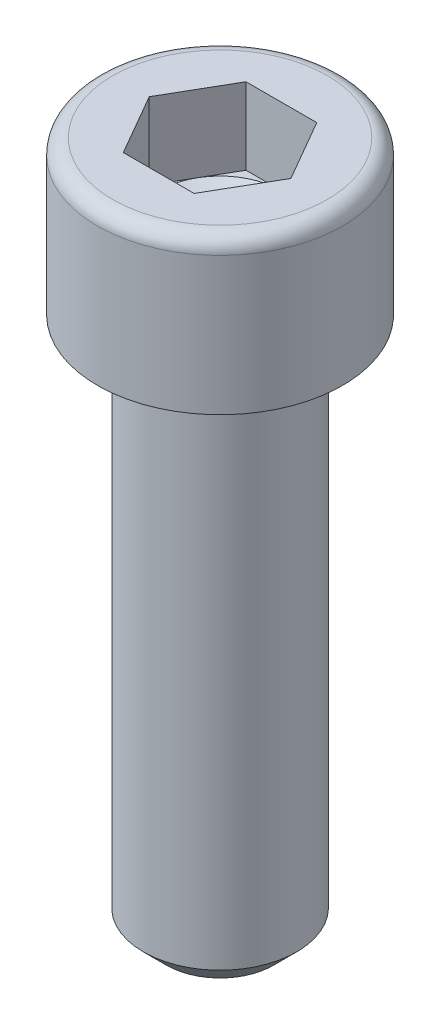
ISO-10303-21;
HEADER;
FILE_DESCRIPTION(('STEP AP214'),'2;1');
FILE_NAME('part.step','',(''),(''),'','','');
FILE_SCHEMA(('AUTOMOTIVE_DESIGN { 1 0 10303 214 1 1 1 1 }'));
ENDSEC;
DATA;
#1=APPLICATION_CONTEXT('core data for automotive mechanical design processes');
#2=APPLICATION_PROTOCOL_DEFINITION('international standard','automotive_design',2000,#1);
#3=PRODUCT_CONTEXT('',#1,'mechanical');
#4=PRODUCT('Part','Part','',(#3));
#5=PRODUCT_RELATED_PRODUCT_CATEGORY('part','',(#4));
#6=PRODUCT_DEFINITION_FORMATION('','',#4);
#7=PRODUCT_DEFINITION_CONTEXT('part definition',#1,'design');
#8=PRODUCT_DEFINITION('design','',#6,#7);
#9=PRODUCT_DEFINITION_SHAPE('','',#8);
#10=(LENGTH_UNIT() NAMED_UNIT(*) SI_UNIT(.MILLI.,.METRE.));
#11=(NAMED_UNIT(*) PLANE_ANGLE_UNIT() SI_UNIT($,.RADIAN.));
#12=(NAMED_UNIT(*) SI_UNIT($,.STERADIAN.) SOLID_ANGLE_UNIT());
#13=UNCERTAINTY_MEASURE_WITH_UNIT(LENGTH_MEASURE(1.E-05),#10,'distance_accuracy_value','');
#14=(GEOMETRIC_REPRESENTATION_CONTEXT(3) GLOBAL_UNCERTAINTY_ASSIGNED_CONTEXT((#13)) GLOBAL_UNIT_ASSIGNED_CONTEXT((#10,
#11,#12)) REPRESENTATION_CONTEXT('',''));
#15=CARTESIAN_POINT('',(0.,0.,0.));
#16=DIRECTION('',(0.,0.,1.));
#17=DIRECTION('',(1.,0.,0.));
#18=AXIS2_PLACEMENT_3D('',#15,#16,#17);
#19=CARTESIAN_POINT('',(4.,10.,0.));
#20=DIRECTION('',(0.,-1.,0.));
#21=DIRECTION('',(1.,0.,0.));
#22=AXIS2_PLACEMENT_3D('',#19,#20,#21);
#23=PLANE('',#22);
#24=CARTESIAN_POINT('',(0.,10.,0.));
#25=DIRECTION('',(0.,1.,0.));
#26=DIRECTION('',(-1.,0.,0.));
#27=AXIS2_PLACEMENT_3D('',#24,#25,#26);
#28=CIRCLE('',#27,7.);
#29=CARTESIAN_POINT('',(-7.,10.,0.));
#30=VERTEX_POINT('',#29);
#31=EDGE_CURVE('E141',#30,#30,#28,.T.);
#32=ORIENTED_EDGE('',*,*,#31,.T.);
#33=EDGE_LOOP('',(#32));
#34=FACE_BOUND('',#33,.T.);
#35=DIRECTION('',(0.499999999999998,0.,0.86602540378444));
#36=VECTOR('',#35,1.);
#37=CARTESIAN_POINT('',(2.30940107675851,10.,-4.));
#38=LINE('',#37,#36);
#39=CARTESIAN_POINT('',(2.30940107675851,10.,-4.));
#40=VERTEX_POINT('',#39);
#41=CARTESIAN_POINT('',(4.618802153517,10.,0.));
#42=VERTEX_POINT('',#41);
#43=EDGE_CURVE('E373',#40,#42,#38,.T.);
#44=ORIENTED_EDGE('',*,*,#43,.T.);
#45=DIRECTION('',(-0.499999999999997,0.,0.86602540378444));
#46=VECTOR('',#45,1.);
#47=CARTESIAN_POINT('',(2.30940107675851,10.,4.));
#48=LINE('',#47,#46);
#49=CARTESIAN_POINT('',(2.30940107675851,10.,4.));
#50=VERTEX_POINT('',#49);
#51=EDGE_CURVE('E376',#42,#50,#48,.T.);
#52=ORIENTED_EDGE('',*,*,#51,.T.);
#53=DIRECTION('',(-1.,0.,0.));
#54=VECTOR('',#53,1.);
#55=CARTESIAN_POINT('',(2.30940107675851,10.,4.));
#56=LINE('',#55,#54);
#57=CARTESIAN_POINT('',(-2.30940107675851,10.,4.));
#58=VERTEX_POINT('',#57);
#59=EDGE_CURVE('E379',#50,#58,#56,.T.);
#60=ORIENTED_EDGE('',*,*,#59,.T.);
#61=DIRECTION('',(-0.499999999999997,0.,-0.86602540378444));
#62=VECTOR('',#61,1.);
#63=CARTESIAN_POINT('',(-2.30940107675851,10.,4.));
#64=LINE('',#63,#62);
#65=CARTESIAN_POINT('',(-4.618802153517,10.,0.));
#66=VERTEX_POINT('',#65);
#67=EDGE_CURVE('E118',#58,#66,#64,.T.);
#68=ORIENTED_EDGE('',*,*,#67,.T.);
#69=DIRECTION('',(0.499999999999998,0.,-0.86602540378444));
#70=VECTOR('',#69,1.);
#71=CARTESIAN_POINT('',(-2.30940107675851,10.,-4.));
#72=LINE('',#71,#70);
#73=CARTESIAN_POINT('',(-2.30940107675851,10.,-4.));
#74=VERTEX_POINT('',#73);
#75=EDGE_CURVE('E370',#66,#74,#72,.T.);
#76=ORIENTED_EDGE('',*,*,#75,.T.);
#77=DIRECTION('',(1.,0.,0.));
#78=VECTOR('',#77,1.);
#79=CARTESIAN_POINT('',(2.30940107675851,10.,-4.));
#80=LINE('',#79,#78);
#81=EDGE_CURVE('E129',#74,#40,#80,.T.);
#82=ORIENTED_EDGE('',*,*,#81,.T.);
#83=EDGE_LOOP('',(#44,#52,#60,#68,#76,#82));
#84=FACE_BOUND('',#83,.T.);
#85=ADVANCED_FACE('F35',(#34,#84),#23,.F.);
#86=CARTESIAN_POINT('',(0.,-35.,0.));
#87=DIRECTION('',(0.,1.,0.));
#88=DIRECTION('',(0.,0.,1.));
#89=AXIS2_PLACEMENT_3D('',#86,#87,#88);
#90=CYLINDRICAL_SURFACE('',#89,5.);
#91=CARTESIAN_POINT('',(0.,-33.5,0.));
#92=DIRECTION('',(0.,1.,0.));
#93=DIRECTION('',(0.,0.,1.));
#94=AXIS2_PLACEMENT_3D('',#91,#92,#93);
#95=CIRCLE('',#94,5.);
#96=CARTESIAN_POINT('',(0.,-33.5,5.));
#97=VERTEX_POINT('',#96);
#98=EDGE_CURVE('E43',#97,#97,#95,.T.);
#99=ORIENTED_EDGE('',*,*,#98,.T.);
#100=EDGE_LOOP('',(#99));
#101=FACE_BOUND('',#100,.T.);
#102=CARTESIAN_POINT('',(0.,0.,0.));
#103=DIRECTION('',(0.,1.,0.));
#104=DIRECTION('',(0.,0.,1.));
#105=AXIS2_PLACEMENT_3D('',#102,#103,#104);
#106=CIRCLE('',#105,5.);
#107=CARTESIAN_POINT('',(0.,0.,5.));
#108=VERTEX_POINT('',#107);
#109=EDGE_CURVE('E151',#108,#108,#106,.T.);
#110=ORIENTED_EDGE('',*,*,#109,.F.);
#111=EDGE_LOOP('',(#110));
#112=FACE_BOUND('',#111,.T.);
#113=ADVANCED_FACE('F156',(#101,#112),#90,.T.);
#114=CARTESIAN_POINT('',(0.,-35.,0.));
#115=DIRECTION('',(0.,1.,0.));
#116=DIRECTION('',(0.,0.,1.));
#117=AXIS2_PLACEMENT_3D('',#114,#115,#116);
#118=PLANE('',#117);
#119=CARTESIAN_POINT('',(0.,-35.,0.));
#120=DIRECTION('',(0.,1.,0.));
#121=DIRECTION('',(0.,0.,1.));
#122=AXIS2_PLACEMENT_3D('',#119,#120,#121);
#123=CIRCLE('',#122,3.49999999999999);
#124=CARTESIAN_POINT('',(0.,-35.,3.49999999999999));
#125=VERTEX_POINT('',#124);
#126=EDGE_CURVE('E11',#125,#125,#123,.F.);
#127=ORIENTED_EDGE('',*,*,#126,.T.);
#128=EDGE_LOOP('',(#127));
#129=FACE_BOUND('',#128,.T.);
#130=ADVANCED_FACE('F161',(#129),#118,.F.);
#131=CARTESIAN_POINT('',(0.,-33.5,0.));
#132=DIRECTION('',(0.,1.,0.));
#133=DIRECTION('',(0.,0.,1.));
#134=AXIS2_PLACEMENT_3D('',#131,#132,#133);
#135=CONICAL_SURFACE('',#134,5.,0.785398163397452);
#136=ORIENTED_EDGE('',*,*,#126,.F.);
#137=EDGE_LOOP('',(#136));
#138=FACE_BOUND('',#137,.T.);
#139=ORIENTED_EDGE('',*,*,#98,.F.);
#140=EDGE_LOOP('',(#139));
#141=FACE_BOUND('',#140,.T.);
#142=ADVANCED_FACE('F37',(#138,#141),#135,.T.);
#143=CARTESIAN_POINT('',(0.,0.,0.));
#144=DIRECTION('',(0.,1.,0.));
#145=DIRECTION('',(-1.,0.,0.));
#146=AXIS2_PLACEMENT_3D('',#143,#144,#145);
#147=PLANE('',#146);
#148=ORIENTED_EDGE('',*,*,#109,.T.);
#149=EDGE_LOOP('',(#148));
#150=FACE_BOUND('',#149,.T.);
#151=CARTESIAN_POINT('',(0.,0.,0.));
#152=DIRECTION('',(0.,1.,0.));
#153=DIRECTION('',(-1.,0.,0.));
#154=AXIS2_PLACEMENT_3D('',#151,#152,#153);
#155=CIRCLE('',#154,8.);
#156=CARTESIAN_POINT('',(-8.,0.,0.));
#157=VERTEX_POINT('',#156);
#158=EDGE_CURVE('E148',#157,#157,#155,.T.);
#159=ORIENTED_EDGE('',*,*,#158,.F.);
#160=EDGE_LOOP('',(#159));
#161=FACE_BOUND('',#160,.T.);
#162=ADVANCED_FACE('F160',(#150,#161),#147,.F.);
#163=CARTESIAN_POINT('',(0.,10.,0.));
#164=DIRECTION('',(0.,1.,0.));
#165=DIRECTION('',(-1.,0.,0.));
#166=AXIS2_PLACEMENT_3D('',#163,#164,#165);
#167=CYLINDRICAL_SURFACE('',#166,8.);
#168=CARTESIAN_POINT('',(0.,9.,0.));
#169=DIRECTION('',(0.,1.,0.));
#170=DIRECTION('',(-1.,0.,0.));
#171=AXIS2_PLACEMENT_3D('',#168,#169,#170);
#172=CIRCLE('',#171,8.);
#173=CARTESIAN_POINT('',(-8.,9.,0.));
#174=VERTEX_POINT('',#173);
#175=EDGE_CURVE('E145',#174,#174,#172,.T.);
#176=ORIENTED_EDGE('',*,*,#175,.F.);
#177=EDGE_LOOP('',(#176));
#178=FACE_BOUND('',#177,.T.);
#179=ORIENTED_EDGE('',*,*,#158,.T.);
#180=EDGE_LOOP('',(#179));
#181=FACE_BOUND('',#180,.T.);
#182=ADVANCED_FACE('F167',(#178,#181),#167,.T.);
#183=CARTESIAN_POINT('',(0.,9.,0.));
#184=DIRECTION('',(0.,1.,0.));
#185=DIRECTION('',(-1.,0.,0.));
#186=AXIS2_PLACEMENT_3D('',#183,#184,#185);
#187=TOROIDAL_SURFACE('',#186,7.,0.999999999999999);
#188=ORIENTED_EDGE('',*,*,#31,.F.);
#189=EDGE_LOOP('',(#188));
#190=FACE_BOUND('',#189,.T.);
#191=ORIENTED_EDGE('',*,*,#175,.T.);
#192=EDGE_LOOP('',(#191));
#193=FACE_BOUND('',#192,.T.);
#194=ADVANCED_FACE('F184',(#190,#193),#187,.T.);
#195=CARTESIAN_POINT('',(-2.30940107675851,5.,-4.));
#196=DIRECTION('',(0.86602540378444,0.,0.499999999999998));
#197=DIRECTION('',(0.499999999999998,0.,-0.86602540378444));
#198=AXIS2_PLACEMENT_3D('',#195,#196,#197);
#199=PLANE('',#198);
#200=ORIENTED_EDGE('',*,*,#75,.F.);
#201=DIRECTION('',(0.,1.,0.));
#202=VECTOR('',#201,1.);
#203=CARTESIAN_POINT('',(-4.618802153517,5.,0.));
#204=LINE('',#203,#202);
#205=CARTESIAN_POINT('',(-4.618802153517,5.,0.));
#206=VERTEX_POINT('',#205);
#207=EDGE_CURVE('E365',#206,#66,#204,.T.);
#208=ORIENTED_EDGE('',*,*,#207,.F.);
#209=DIRECTION('',(0.499999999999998,0.,-0.86602540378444));
#210=VECTOR('',#209,1.);
#211=CARTESIAN_POINT('',(-2.30940107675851,5.,-4.));
#212=LINE('',#211,#210);
#213=CARTESIAN_POINT('',(-3.46410161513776,5.,-1.99999999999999));
#214=VERTEX_POINT('',#213);
#215=EDGE_CURVE('E114',#206,#214,#212,.T.);
#216=ORIENTED_EDGE('',*,*,#215,.T.);
#217=CARTESIAN_POINT('',(-2.30940107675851,5.,-4.));
#218=VERTEX_POINT('',#217);
#219=EDGE_CURVE('E108',#214,#218,#212,.T.);
#220=ORIENTED_EDGE('',*,*,#219,.T.);
#221=DIRECTION('',(0.,1.,0.));
#222=VECTOR('',#221,1.);
#223=CARTESIAN_POINT('',(-2.30940107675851,5.,-4.));
#224=LINE('',#223,#222);
#225=EDGE_CURVE('E110',#218,#74,#224,.T.);
#226=ORIENTED_EDGE('',*,*,#225,.T.);
#227=EDGE_LOOP('',(#200,#208,#216,#220,#226));
#228=FACE_BOUND('',#227,.T.);
#229=ADVANCED_FACE('F109',(#228),#199,.T.);
#230=CARTESIAN_POINT('',(2.30940107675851,5.,-4.));
#231=DIRECTION('',(0.,0.,1.));
#232=DIRECTION('',(1.,0.,0.));
#233=AXIS2_PLACEMENT_3D('',#230,#231,#232);
#234=PLANE('',#233);
#235=ORIENTED_EDGE('',*,*,#81,.F.);
#236=ORIENTED_EDGE('',*,*,#225,.F.);
#237=DIRECTION('',(1.,0.,0.));
#238=VECTOR('',#237,1.);
#239=CARTESIAN_POINT('',(2.30940107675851,5.,-4.));
#240=LINE('',#239,#238);
#241=CARTESIAN_POINT('',(0.,5.,-4.));
#242=VERTEX_POINT('',#241);
#243=EDGE_CURVE('E50',#218,#242,#240,.T.);
#244=ORIENTED_EDGE('',*,*,#243,.T.);
#245=CARTESIAN_POINT('',(2.30940107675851,5.,-4.));
#246=VERTEX_POINT('',#245);
#247=EDGE_CURVE('E124',#242,#246,#240,.T.);
#248=ORIENTED_EDGE('',*,*,#247,.T.);
#249=DIRECTION('',(0.,1.,0.));
#250=VECTOR('',#249,1.);
#251=CARTESIAN_POINT('',(2.30940107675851,5.,-4.));
#252=LINE('',#251,#250);
#253=EDGE_CURVE('E131',#246,#40,#252,.T.);
#254=ORIENTED_EDGE('',*,*,#253,.T.);
#255=EDGE_LOOP('',(#235,#236,#244,#248,#254));
#256=FACE_BOUND('',#255,.T.);
#257=ADVANCED_FACE('F126',(#256),#234,.T.);
#258=CARTESIAN_POINT('',(2.30940107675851,5.,-4.));
#259=DIRECTION('',(-0.86602540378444,0.,0.499999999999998));
#260=DIRECTION('',(0.499999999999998,0.,0.86602540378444));
#261=AXIS2_PLACEMENT_3D('',#258,#259,#260);
#262=PLANE('',#261);
#263=ORIENTED_EDGE('',*,*,#43,.F.);
#264=ORIENTED_EDGE('',*,*,#253,.F.);
#265=DIRECTION('',(0.499999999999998,0.,0.86602540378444));
#266=VECTOR('',#265,1.);
#267=CARTESIAN_POINT('',(2.30940107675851,5.,-4.));
#268=LINE('',#267,#266);
#269=CARTESIAN_POINT('',(3.46410161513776,5.,-1.99999999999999));
#270=VERTEX_POINT('',#269);
#271=EDGE_CURVE('E398',#246,#270,#268,.T.);
#272=ORIENTED_EDGE('',*,*,#271,.T.);
#273=CARTESIAN_POINT('',(4.618802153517,5.,0.));
#274=VERTEX_POINT('',#273);
#275=EDGE_CURVE('E123',#270,#274,#268,.T.);
#276=ORIENTED_EDGE('',*,*,#275,.T.);
#277=DIRECTION('',(0.,1.,0.));
#278=VECTOR('',#277,1.);
#279=CARTESIAN_POINT('',(4.618802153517,5.,0.));
#280=LINE('',#279,#278);
#281=EDGE_CURVE('E136',#274,#42,#280,.T.);
#282=ORIENTED_EDGE('',*,*,#281,.T.);
#283=EDGE_LOOP('',(#263,#264,#272,#276,#282));
#284=FACE_BOUND('',#283,.T.);
#285=ADVANCED_FACE('F214',(#284),#262,.T.);
#286=CARTESIAN_POINT('',(2.30940107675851,5.,4.));
#287=DIRECTION('',(-0.86602540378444,0.,-0.499999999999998));
#288=DIRECTION('',(-0.499999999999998,0.,0.86602540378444));
#289=AXIS2_PLACEMENT_3D('',#286,#287,#288);
#290=PLANE('',#289);
#291=ORIENTED_EDGE('',*,*,#51,.F.);
#292=ORIENTED_EDGE('',*,*,#281,.F.);
#293=DIRECTION('',(-0.499999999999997,0.,0.86602540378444));
#294=VECTOR('',#293,1.);
#295=CARTESIAN_POINT('',(2.30940107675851,5.,4.));
#296=LINE('',#295,#294);
#297=CARTESIAN_POINT('',(3.46410161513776,5.,1.99999999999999));
#298=VERTEX_POINT('',#297);
#299=EDGE_CURVE('E396',#274,#298,#296,.T.);
#300=ORIENTED_EDGE('',*,*,#299,.T.);
#301=CARTESIAN_POINT('',(2.30940107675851,5.,4.));
#302=VERTEX_POINT('',#301);
#303=EDGE_CURVE('E397',#298,#302,#296,.T.);
#304=ORIENTED_EDGE('',*,*,#303,.T.);
#305=DIRECTION('',(0.,1.,0.));
#306=VECTOR('',#305,1.);
#307=CARTESIAN_POINT('',(2.30940107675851,5.,4.));
#308=LINE('',#307,#306);
#309=EDGE_CURVE('E385',#302,#50,#308,.T.);
#310=ORIENTED_EDGE('',*,*,#309,.T.);
#311=EDGE_LOOP('',(#291,#292,#300,#304,#310));
#312=FACE_BOUND('',#311,.T.);
#313=ADVANCED_FACE('F221',(#312),#290,.T.);
#314=CARTESIAN_POINT('',(2.30940107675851,5.,4.));
#315=DIRECTION('',(0.,0.,-1.));
#316=DIRECTION('',(-1.,0.,0.));
#317=AXIS2_PLACEMENT_3D('',#314,#315,#316);
#318=PLANE('',#317);
#319=ORIENTED_EDGE('',*,*,#59,.F.);
#320=ORIENTED_EDGE('',*,*,#309,.F.);
#321=DIRECTION('',(-1.,0.,0.));
#322=VECTOR('',#321,1.);
#323=CARTESIAN_POINT('',(2.30940107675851,5.,4.));
#324=LINE('',#323,#322);
#325=CARTESIAN_POINT('',(0.,5.,4.));
#326=VERTEX_POINT('',#325);
#327=EDGE_CURVE('E360',#302,#326,#324,.T.);
#328=ORIENTED_EDGE('',*,*,#327,.T.);
#329=CARTESIAN_POINT('',(-2.30940107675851,5.,4.));
#330=VERTEX_POINT('',#329);
#331=EDGE_CURVE('E356',#326,#330,#324,.T.);
#332=ORIENTED_EDGE('',*,*,#331,.T.);
#333=DIRECTION('',(0.,1.,0.));
#334=VECTOR('',#333,1.);
#335=CARTESIAN_POINT('',(-2.30940107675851,5.,4.));
#336=LINE('',#335,#334);
#337=EDGE_CURVE('E364',#330,#58,#336,.T.);
#338=ORIENTED_EDGE('',*,*,#337,.T.);
#339=EDGE_LOOP('',(#319,#320,#328,#332,#338));
#340=FACE_BOUND('',#339,.T.);
#341=ADVANCED_FACE('F229',(#340),#318,.T.);
#342=CARTESIAN_POINT('',(-2.30940107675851,5.,4.));
#343=DIRECTION('',(0.86602540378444,0.,-0.499999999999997));
#344=DIRECTION('',(-0.499999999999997,0.,-0.86602540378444));
#345=AXIS2_PLACEMENT_3D('',#342,#343,#344);
#346=PLANE('',#345);
#347=ORIENTED_EDGE('',*,*,#67,.F.);
#348=ORIENTED_EDGE('',*,*,#337,.F.);
#349=DIRECTION('',(-0.499999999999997,0.,-0.86602540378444));
#350=VECTOR('',#349,1.);
#351=CARTESIAN_POINT('',(-2.30940107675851,5.,4.));
#352=LINE('',#351,#350);
#353=CARTESIAN_POINT('',(-3.46410161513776,5.,1.99999999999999));
#354=VERTEX_POINT('',#353);
#355=EDGE_CURVE('E355',#330,#354,#352,.T.);
#356=ORIENTED_EDGE('',*,*,#355,.T.);
#357=EDGE_CURVE('E358',#354,#206,#352,.T.);
#358=ORIENTED_EDGE('',*,*,#357,.T.);
#359=ORIENTED_EDGE('',*,*,#207,.T.);
#360=EDGE_LOOP('',(#347,#348,#356,#358,#359));
#361=FACE_BOUND('',#360,.T.);
#362=ADVANCED_FACE('F237',(#361),#346,.T.);
#363=CARTESIAN_POINT('',(-6.92820323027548,5.,4.));
#364=DIRECTION('',(0.,-1.,0.));
#365=DIRECTION('',(0.,0.,-1.));
#366=AXIS2_PLACEMENT_3D('',#363,#364,#365);
#367=PLANE('',#366);
#368=ORIENTED_EDGE('',*,*,#243,.F.);
#369=ORIENTED_EDGE('',*,*,#219,.F.);
#370=CARTESIAN_POINT('',(0.,5.,0.));
#371=DIRECTION('',(0.,1.,0.));
#372=DIRECTION('',(-1.,0.,0.));
#373=AXIS2_PLACEMENT_3D('',#370,#371,#372);
#374=CIRCLE('',#373,4.);
#375=EDGE_CURVE('E121',#242,#214,#374,.T.);
#376=ORIENTED_EDGE('',*,*,#375,.F.);
#377=EDGE_LOOP('',(#368,#369,#376));
#378=FACE_BOUND('',#377,.T.);
#379=ADVANCED_FACE('F120',(#378),#367,.F.);
#380=ORIENTED_EDGE('',*,*,#215,.F.);
#381=ORIENTED_EDGE('',*,*,#357,.F.);
#382=EDGE_CURVE('E130',#214,#354,#374,.T.);
#383=ORIENTED_EDGE('',*,*,#382,.F.);
#384=EDGE_LOOP('',(#380,#381,#383));
#385=FACE_BOUND('',#384,.T.);
#386=ADVANCED_FACE('F252',(#385),#367,.F.);
#387=ORIENTED_EDGE('',*,*,#355,.F.);
#388=ORIENTED_EDGE('',*,*,#331,.F.);
#389=EDGE_CURVE('E135',#354,#326,#374,.T.);
#390=ORIENTED_EDGE('',*,*,#389,.F.);
#391=EDGE_LOOP('',(#387,#388,#390));
#392=FACE_BOUND('',#391,.T.);
#393=ADVANCED_FACE('F260',(#392),#367,.F.);
#394=ORIENTED_EDGE('',*,*,#327,.F.);
#395=ORIENTED_EDGE('',*,*,#303,.F.);
#396=EDGE_CURVE('E142',#326,#298,#374,.T.);
#397=ORIENTED_EDGE('',*,*,#396,.F.);
#398=EDGE_LOOP('',(#394,#395,#397));
#399=FACE_BOUND('',#398,.T.);
#400=ADVANCED_FACE('F267',(#399),#367,.F.);
#401=ORIENTED_EDGE('',*,*,#299,.F.);
#402=ORIENTED_EDGE('',*,*,#275,.F.);
#403=EDGE_CURVE('E402',#298,#270,#374,.T.);
#404=ORIENTED_EDGE('',*,*,#403,.F.);
#405=EDGE_LOOP('',(#401,#402,#404));
#406=FACE_BOUND('',#405,.T.);
#407=ADVANCED_FACE('F274',(#406),#367,.F.);
#408=ORIENTED_EDGE('',*,*,#271,.F.);
#409=ORIENTED_EDGE('',*,*,#247,.F.);
#410=EDGE_CURVE('E401',#270,#242,#374,.T.);
#411=ORIENTED_EDGE('',*,*,#410,.F.);
#412=EDGE_LOOP('',(#408,#409,#411));
#413=FACE_BOUND('',#412,.T.);
#414=ADVANCED_FACE('F254',(#413),#367,.F.);
#415=CARTESIAN_POINT('',(0.,5.,0.));
#416=DIRECTION('',(0.,1.,0.));
#417=DIRECTION('',(-1.,0.,0.));
#418=AXIS2_PLACEMENT_3D('',#415,#416,#417);
#419=CONICAL_SURFACE('',#418,4.,1.04719755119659);
#420=CARTESIAN_POINT('',(0.,2.69059892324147,0.));
#421=VERTEX_POINT('',#420);
#422=VERTEX_LOOP('',#421);
#423=FACE_BOUND('',#422,.T.);
#424=ORIENTED_EDGE('',*,*,#389,.T.);
#425=ORIENTED_EDGE('',*,*,#396,.T.);
#426=ORIENTED_EDGE('',*,*,#403,.T.);
#427=ORIENTED_EDGE('',*,*,#410,.T.);
#428=ORIENTED_EDGE('',*,*,#375,.T.);
#429=ORIENTED_EDGE('',*,*,#382,.T.);
#430=EDGE_LOOP('',(#424,#425,#426,#427,#428,#429));
#431=FACE_BOUND('',#430,.T.);
#432=ADVANCED_FACE('F182',(#423,#431),#419,.F.);
#433=CLOSED_SHELL('',(#85,#113,#130,#142,#162,#182,#194,#229,#257,#285,#313,#341,#362,#379,#386,
#393,#400,#407,#414,#432));
#434=MANIFOLD_SOLID_BREP('B2',#433);
#435=ADVANCED_BREP_SHAPE_REPRESENTATION('',(#18,#434),#14);
#436=SHAPE_DEFINITION_REPRESENTATION(#9,#435);
ENDSEC;
END-ISO-10303-21;
